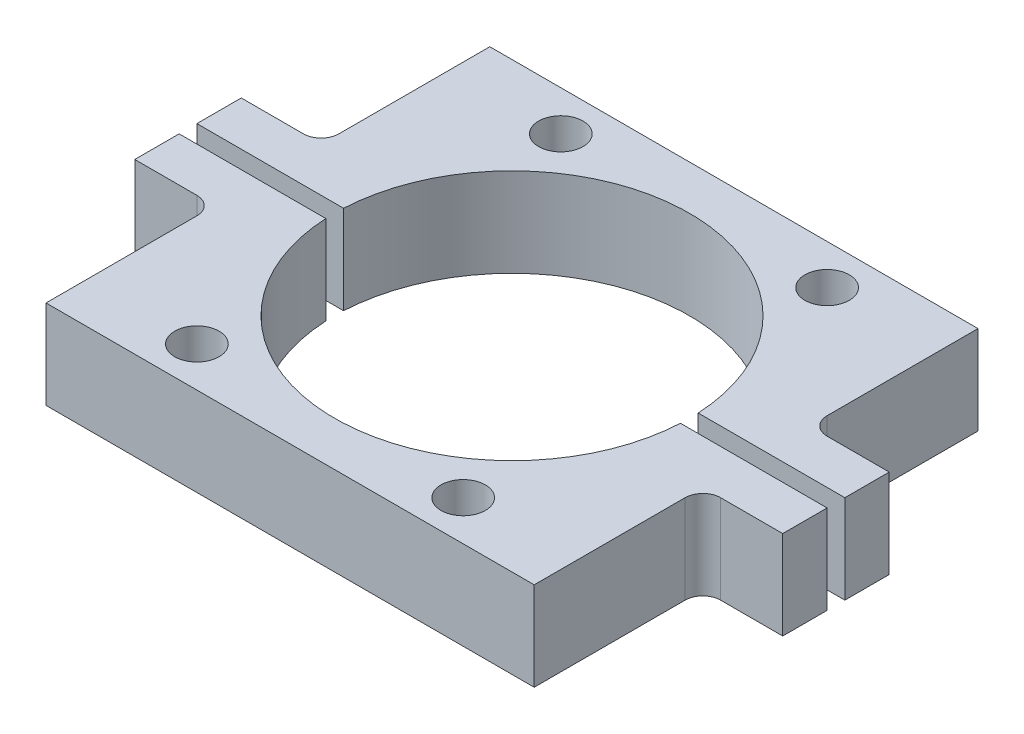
ISO-10303-21;
HEADER;
FILE_DESCRIPTION(('STEP AP214'),'2;1');
FILE_NAME('part.step','',(''),(''),'','','');
FILE_SCHEMA(('AUTOMOTIVE_DESIGN { 1 0 10303 214 1 1 1 1 }'));
ENDSEC;
DATA;
#1=APPLICATION_CONTEXT('core data for automotive mechanical design processes');
#2=APPLICATION_PROTOCOL_DEFINITION('international standard','automotive_design',2000,#1);
#3=PRODUCT_CONTEXT('',#1,'mechanical');
#4=PRODUCT('Part','Part','',(#3));
#5=PRODUCT_RELATED_PRODUCT_CATEGORY('part','',(#4));
#6=PRODUCT_DEFINITION_FORMATION('','',#4);
#7=PRODUCT_DEFINITION_CONTEXT('part definition',#1,'design');
#8=PRODUCT_DEFINITION('design','',#6,#7);
#9=PRODUCT_DEFINITION_SHAPE('','',#8);
#10=(LENGTH_UNIT() NAMED_UNIT(*) SI_UNIT(.MILLI.,.METRE.));
#11=(NAMED_UNIT(*) PLANE_ANGLE_UNIT() SI_UNIT($,.RADIAN.));
#12=(NAMED_UNIT(*) SI_UNIT($,.STERADIAN.) SOLID_ANGLE_UNIT());
#13=UNCERTAINTY_MEASURE_WITH_UNIT(LENGTH_MEASURE(1.E-05),#10,'distance_accuracy_value','');
#14=(GEOMETRIC_REPRESENTATION_CONTEXT(3) GLOBAL_UNCERTAINTY_ASSIGNED_CONTEXT((#13)) GLOBAL_UNIT_ASSIGNED_CONTEXT((#10,
#11,#12)) REPRESENTATION_CONTEXT('',''));
#15=CARTESIAN_POINT('',(0.,0.,0.));
#16=DIRECTION('',(0.,0.,1.));
#17=DIRECTION('',(1.,0.,0.));
#18=AXIS2_PLACEMENT_3D('',#15,#16,#17);
#19=CARTESIAN_POINT('',(0.,20.,0.));
#20=DIRECTION('',(0.,1.,0.));
#21=DIRECTION('',(0.,0.,1.));
#22=AXIS2_PLACEMENT_3D('',#19,#20,#21);
#23=PLANE('',#22);
#24=CARTESIAN_POINT('',(-30.,20.,-41.));
#25=DIRECTION('',(0.,1.,0.));
#26=DIRECTION('',(0.,0.,1.));
#27=AXIS2_PLACEMENT_3D('',#24,#25,#26);
#28=CIRCLE('',#27,5.);
#29=CARTESIAN_POINT('',(-30.,20.,-36.));
#30=VERTEX_POINT('',#29);
#31=EDGE_CURVE('E389',#30,#30,#28,.T.);
#32=ORIENTED_EDGE('',*,*,#31,.F.);
#33=EDGE_LOOP('',(#32));
#34=FACE_BOUND('',#33,.T.);
#35=DIRECTION('',(0.,0.,1.));
#36=VECTOR('',#35,1.);
#37=CARTESIAN_POINT('',(-55.,20.,-12.));
#38=LINE('',#37,#36);
#39=CARTESIAN_POINT('',(-55.,20.,-50.));
#40=VERTEX_POINT('',#39);
#41=CARTESIAN_POINT('',(-55.,20.,-16.));
#42=VERTEX_POINT('',#41);
#43=EDGE_CURVE('E142',#40,#42,#38,.T.);
#44=ORIENTED_EDGE('',*,*,#43,.T.);
#45=CARTESIAN_POINT('',(-59.,20.,-16.));
#46=DIRECTION('',(0.,1.,0.));
#47=DIRECTION('',(0.,0.,1.));
#48=AXIS2_PLACEMENT_3D('',#45,#46,#47);
#49=CIRCLE('',#48,4.);
#50=CARTESIAN_POINT('',(-59.,20.,-12.));
#51=VERTEX_POINT('',#50);
#52=EDGE_CURVE('E138',#42,#51,#49,.F.);
#53=ORIENTED_EDGE('',*,*,#52,.T.);
#54=DIRECTION('',(-1.,0.,0.));
#55=VECTOR('',#54,1.);
#56=CARTESIAN_POINT('',(-55.,20.,-12.));
#57=LINE('',#56,#55);
#58=CARTESIAN_POINT('',(-73.,20.,-12.));
#59=VERTEX_POINT('',#58);
#60=EDGE_CURVE('E130',#51,#59,#57,.T.);
#61=ORIENTED_EDGE('',*,*,#60,.T.);
#62=DIRECTION('',(0.,0.,1.));
#63=VECTOR('',#62,1.);
#64=CARTESIAN_POINT('',(-73.,20.,-12.));
#65=LINE('',#64,#63);
#66=CARTESIAN_POINT('',(-73.,20.,-2.));
#67=VERTEX_POINT('',#66);
#68=EDGE_CURVE('E135',#59,#67,#65,.T.);
#69=ORIENTED_EDGE('',*,*,#68,.T.);
#70=DIRECTION('',(1.,0.,0.));
#71=VECTOR('',#70,1.);
#72=CARTESIAN_POINT('',(-39.9499687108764,20.,-2.));
#73=LINE('',#72,#71);
#74=CARTESIAN_POINT('',(-39.9499687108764,20.,-2.00000000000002));
#75=VERTEX_POINT('',#74);
#76=EDGE_CURVE('E157',#67,#75,#73,.T.);
#77=ORIENTED_EDGE('',*,*,#76,.T.);
#78=CARTESIAN_POINT('',(0.,20.,0.));
#79=DIRECTION('',(0.,-1.,0.));
#80=DIRECTION('',(0.,0.,1.));
#81=AXIS2_PLACEMENT_3D('',#78,#79,#80);
#82=CIRCLE('',#81,40.);
#83=CARTESIAN_POINT('',(39.9499687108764,20.,-2.));
#84=VERTEX_POINT('',#83);
#85=EDGE_CURVE('E159',#75,#84,#82,.T.);
#86=ORIENTED_EDGE('',*,*,#85,.T.);
#87=DIRECTION('',(1.,0.,0.));
#88=VECTOR('',#87,1.);
#89=CARTESIAN_POINT('',(73.,20.,-2.));
#90=LINE('',#89,#88);
#91=CARTESIAN_POINT('',(73.,20.,-2.));
#92=VERTEX_POINT('',#91);
#93=EDGE_CURVE('E164',#84,#92,#90,.T.);
#94=ORIENTED_EDGE('',*,*,#93,.T.);
#95=DIRECTION('',(0.,0.,-1.));
#96=VECTOR('',#95,1.);
#97=CARTESIAN_POINT('',(73.,20.,-12.));
#98=LINE('',#97,#96);
#99=CARTESIAN_POINT('',(73.,20.,-12.));
#100=VERTEX_POINT('',#99);
#101=EDGE_CURVE('E166',#92,#100,#98,.T.);
#102=ORIENTED_EDGE('',*,*,#101,.T.);
#103=DIRECTION('',(-1.,0.,0.));
#104=VECTOR('',#103,1.);
#105=CARTESIAN_POINT('',(73.,20.,-12.));
#106=LINE('',#105,#104);
#107=CARTESIAN_POINT('',(59.,20.,-12.));
#108=VERTEX_POINT('',#107);
#109=EDGE_CURVE('E168',#100,#108,#106,.T.);
#110=ORIENTED_EDGE('',*,*,#109,.T.);
#111=CARTESIAN_POINT('',(59.,20.,-16.));
#112=DIRECTION('',(0.,1.,0.));
#113=DIRECTION('',(0.,0.,1.));
#114=AXIS2_PLACEMENT_3D('',#111,#112,#113);
#115=CIRCLE('',#114,4.);
#116=CARTESIAN_POINT('',(55.,20.,-16.));
#117=VERTEX_POINT('',#116);
#118=EDGE_CURVE('E12',#108,#117,#115,.F.);
#119=ORIENTED_EDGE('',*,*,#118,.T.);
#120=DIRECTION('',(0.,0.,-1.));
#121=VECTOR('',#120,1.);
#122=CARTESIAN_POINT('',(55.,20.,-12.));
#123=LINE('',#122,#121);
#124=CARTESIAN_POINT('',(55.,20.,-50.));
#125=VERTEX_POINT('',#124);
#126=EDGE_CURVE('E170',#117,#125,#123,.T.);
#127=ORIENTED_EDGE('',*,*,#126,.T.);
#128=DIRECTION('',(-1.,0.,0.));
#129=VECTOR('',#128,1.);
#130=CARTESIAN_POINT('',(55.,20.,-50.));
#131=LINE('',#130,#129);
#132=EDGE_CURVE('E172',#125,#40,#131,.T.);
#133=ORIENTED_EDGE('',*,*,#132,.T.);
#134=EDGE_LOOP('',(#44,#53,#61,#69,#77,#86,#94,#102,#110,#119,#127,#133));
#135=FACE_BOUND('',#134,.T.);
#136=CARTESIAN_POINT('',(30.,20.,-41.));
#137=DIRECTION('',(0.,1.,0.));
#138=DIRECTION('',(0.,0.,1.));
#139=AXIS2_PLACEMENT_3D('',#136,#137,#138);
#140=CIRCLE('',#139,5.);
#141=CARTESIAN_POINT('',(30.,20.,-36.));
#142=VERTEX_POINT('',#141);
#143=EDGE_CURVE('E178',#142,#142,#140,.T.);
#144=ORIENTED_EDGE('',*,*,#143,.F.);
#145=EDGE_LOOP('',(#144));
#146=FACE_BOUND('',#145,.T.);
#147=ADVANCED_FACE('F42',(#34,#135,#146),#23,.T.);
#148=CARTESIAN_POINT('',(0.,0.,0.));
#149=DIRECTION('',(0.,1.,0.));
#150=DIRECTION('',(0.,0.,1.));
#151=AXIS2_PLACEMENT_3D('',#148,#149,#150);
#152=PLANE('',#151);
#153=CARTESIAN_POINT('',(-30.,0.,-41.));
#154=DIRECTION('',(0.,1.,0.));
#155=DIRECTION('',(0.,0.,1.));
#156=AXIS2_PLACEMENT_3D('',#153,#154,#155);
#157=CIRCLE('',#156,5.);
#158=CARTESIAN_POINT('',(-30.,0.,-36.));
#159=VERTEX_POINT('',#158);
#160=EDGE_CURVE('E392',#159,#159,#157,.T.);
#161=ORIENTED_EDGE('',*,*,#160,.T.);
#162=EDGE_LOOP('',(#161));
#163=FACE_BOUND('',#162,.T.);
#164=DIRECTION('',(0.,0.,1.));
#165=VECTOR('',#164,1.);
#166=CARTESIAN_POINT('',(-55.,0.,-12.));
#167=LINE('',#166,#165);
#168=CARTESIAN_POINT('',(-55.,0.,-50.));
#169=VERTEX_POINT('',#168);
#170=CARTESIAN_POINT('',(-55.,0.,-16.));
#171=VERTEX_POINT('',#170);
#172=EDGE_CURVE('E175',#169,#171,#167,.T.);
#173=ORIENTED_EDGE('',*,*,#172,.F.);
#174=DIRECTION('',(-1.,0.,0.));
#175=VECTOR('',#174,1.);
#176=CARTESIAN_POINT('',(55.,0.,-50.));
#177=LINE('',#176,#175);
#178=CARTESIAN_POINT('',(55.,0.,-50.));
#179=VERTEX_POINT('',#178);
#180=EDGE_CURVE('E194',#179,#169,#177,.T.);
#181=ORIENTED_EDGE('',*,*,#180,.F.);
#182=DIRECTION('',(0.,0.,-1.));
#183=VECTOR('',#182,1.);
#184=CARTESIAN_POINT('',(55.,0.,-12.));
#185=LINE('',#184,#183);
#186=CARTESIAN_POINT('',(55.,0.,-16.));
#187=VERTEX_POINT('',#186);
#188=EDGE_CURVE('E192',#187,#179,#185,.T.);
#189=ORIENTED_EDGE('',*,*,#188,.F.);
#190=CARTESIAN_POINT('',(59.,0.,-16.));
#191=DIRECTION('',(0.,1.,0.));
#192=DIRECTION('',(0.,0.,1.));
#193=AXIS2_PLACEMENT_3D('',#190,#191,#192);
#194=CIRCLE('',#193,4.);
#195=CARTESIAN_POINT('',(59.,0.,-12.));
#196=VERTEX_POINT('',#195);
#197=EDGE_CURVE('E50',#187,#196,#194,.T.);
#198=ORIENTED_EDGE('',*,*,#197,.T.);
#199=DIRECTION('',(-1.,0.,0.));
#200=VECTOR('',#199,1.);
#201=CARTESIAN_POINT('',(73.,0.,-12.));
#202=LINE('',#201,#200);
#203=CARTESIAN_POINT('',(73.,0.,-12.));
#204=VERTEX_POINT('',#203);
#205=EDGE_CURVE('E190',#204,#196,#202,.T.);
#206=ORIENTED_EDGE('',*,*,#205,.F.);
#207=DIRECTION('',(0.,0.,-1.));
#208=VECTOR('',#207,1.);
#209=CARTESIAN_POINT('',(73.,0.,-12.));
#210=LINE('',#209,#208);
#211=CARTESIAN_POINT('',(73.,0.,-2.));
#212=VERTEX_POINT('',#211);
#213=EDGE_CURVE('E188',#212,#204,#210,.T.);
#214=ORIENTED_EDGE('',*,*,#213,.F.);
#215=DIRECTION('',(1.,0.,0.));
#216=VECTOR('',#215,1.);
#217=CARTESIAN_POINT('',(73.,0.,-2.));
#218=LINE('',#217,#216);
#219=CARTESIAN_POINT('',(39.9499687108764,0.,-2.));
#220=VERTEX_POINT('',#219);
#221=EDGE_CURVE('E186',#220,#212,#218,.T.);
#222=ORIENTED_EDGE('',*,*,#221,.F.);
#223=CARTESIAN_POINT('',(0.,0.,0.));
#224=DIRECTION('',(0.,-1.,0.));
#225=DIRECTION('',(0.,0.,1.));
#226=AXIS2_PLACEMENT_3D('',#223,#224,#225);
#227=CIRCLE('',#226,40.);
#228=CARTESIAN_POINT('',(-39.9499687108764,0.,-2.00000000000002));
#229=VERTEX_POINT('',#228);
#230=EDGE_CURVE('E184',#229,#220,#227,.T.);
#231=ORIENTED_EDGE('',*,*,#230,.F.);
#232=DIRECTION('',(1.,0.,0.));
#233=VECTOR('',#232,1.);
#234=CARTESIAN_POINT('',(-39.9499687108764,0.,-2.));
#235=LINE('',#234,#233);
#236=CARTESIAN_POINT('',(-73.,0.,-2.));
#237=VERTEX_POINT('',#236);
#238=EDGE_CURVE('E182',#237,#229,#235,.T.);
#239=ORIENTED_EDGE('',*,*,#238,.F.);
#240=DIRECTION('',(0.,0.,1.));
#241=VECTOR('',#240,1.);
#242=CARTESIAN_POINT('',(-73.,0.,-12.));
#243=LINE('',#242,#241);
#244=CARTESIAN_POINT('',(-73.,0.,-12.));
#245=VERTEX_POINT('',#244);
#246=EDGE_CURVE('E180',#245,#237,#243,.T.);
#247=ORIENTED_EDGE('',*,*,#246,.F.);
#248=DIRECTION('',(-1.,0.,0.));
#249=VECTOR('',#248,1.);
#250=CARTESIAN_POINT('',(-55.,0.,-12.));
#251=LINE('',#250,#249);
#252=CARTESIAN_POINT('',(-59.,0.,-12.));
#253=VERTEX_POINT('',#252);
#254=EDGE_CURVE('E148',#253,#245,#251,.T.);
#255=ORIENTED_EDGE('',*,*,#254,.F.);
#256=CARTESIAN_POINT('',(-59.,0.,-16.));
#257=DIRECTION('',(0.,1.,0.));
#258=DIRECTION('',(0.,0.,1.));
#259=AXIS2_PLACEMENT_3D('',#256,#257,#258);
#260=CIRCLE('',#259,4.);
#261=EDGE_CURVE('E221',#253,#171,#260,.T.);
#262=ORIENTED_EDGE('',*,*,#261,.T.);
#263=EDGE_LOOP('',(#173,#181,#189,#198,#206,#214,#222,#231,#239,#247,#255,#262));
#264=FACE_BOUND('',#263,.T.);
#265=CARTESIAN_POINT('',(30.,0.,-41.));
#266=DIRECTION('',(0.,1.,0.));
#267=DIRECTION('',(0.,0.,1.));
#268=AXIS2_PLACEMENT_3D('',#265,#266,#267);
#269=CIRCLE('',#268,5.);
#270=CARTESIAN_POINT('',(30.,0.,-36.));
#271=VERTEX_POINT('',#270);
#272=EDGE_CURVE('E394',#271,#271,#269,.T.);
#273=ORIENTED_EDGE('',*,*,#272,.T.);
#274=EDGE_LOOP('',(#273));
#275=FACE_BOUND('',#274,.T.);
#276=ADVANCED_FACE('F224',(#163,#264,#275),#152,.F.);
#277=CARTESIAN_POINT('',(-55.,20.,-12.));
#278=DIRECTION('',(1.,0.,0.));
#279=DIRECTION('',(0.,0.,-1.));
#280=AXIS2_PLACEMENT_3D('',#277,#278,#279);
#281=PLANE('',#280);
#282=ORIENTED_EDGE('',*,*,#172,.T.);
#283=DIRECTION('',(0.,-1.,0.));
#284=VECTOR('',#283,1.);
#285=CARTESIAN_POINT('',(-55.,20.,-16.));
#286=LINE('',#285,#284);
#287=EDGE_CURVE('E215',#171,#42,#286,.F.);
#288=ORIENTED_EDGE('',*,*,#287,.T.);
#289=ORIENTED_EDGE('',*,*,#43,.F.);
#290=DIRECTION('',(0.,-1.,0.));
#291=VECTOR('',#290,1.);
#292=CARTESIAN_POINT('',(-55.,20.,-50.));
#293=LINE('',#292,#291);
#294=EDGE_CURVE('E174',#40,#169,#293,.T.);
#295=ORIENTED_EDGE('',*,*,#294,.T.);
#296=EDGE_LOOP('',(#282,#288,#289,#295));
#297=FACE_BOUND('',#296,.T.);
#298=ADVANCED_FACE('F230',(#297),#281,.F.);
#299=CARTESIAN_POINT('',(-55.,20.,-12.));
#300=DIRECTION('',(0.,0.,1.));
#301=DIRECTION('',(1.,0.,0.));
#302=AXIS2_PLACEMENT_3D('',#299,#300,#301);
#303=PLANE('',#302);
#304=ORIENTED_EDGE('',*,*,#60,.F.);
#305=DIRECTION('',(0.,-1.,0.));
#306=VECTOR('',#305,1.);
#307=CARTESIAN_POINT('',(-59.,0.,-12.));
#308=LINE('',#307,#306);
#309=EDGE_CURVE('E151',#51,#253,#308,.T.);
#310=ORIENTED_EDGE('',*,*,#309,.T.);
#311=ORIENTED_EDGE('',*,*,#254,.T.);
#312=DIRECTION('',(0.,-1.,0.));
#313=VECTOR('',#312,1.);
#314=CARTESIAN_POINT('',(-73.,20.,-12.));
#315=LINE('',#314,#313);
#316=EDGE_CURVE('E145',#59,#245,#315,.T.);
#317=ORIENTED_EDGE('',*,*,#316,.F.);
#318=EDGE_LOOP('',(#304,#310,#311,#317));
#319=FACE_BOUND('',#318,.T.);
#320=ADVANCED_FACE('F146',(#319),#303,.F.);
#321=CARTESIAN_POINT('',(-73.,20.,-12.));
#322=DIRECTION('',(1.,0.,0.));
#323=DIRECTION('',(0.,0.,-1.));
#324=AXIS2_PLACEMENT_3D('',#321,#322,#323);
#325=PLANE('',#324);
#326=ORIENTED_EDGE('',*,*,#246,.T.);
#327=DIRECTION('',(0.,-1.,0.));
#328=VECTOR('',#327,1.);
#329=CARTESIAN_POINT('',(-73.,20.,-2.));
#330=LINE('',#329,#328);
#331=EDGE_CURVE('E152',#67,#237,#330,.T.);
#332=ORIENTED_EDGE('',*,*,#331,.F.);
#333=ORIENTED_EDGE('',*,*,#68,.F.);
#334=ORIENTED_EDGE('',*,*,#316,.T.);
#335=EDGE_LOOP('',(#326,#332,#333,#334));
#336=FACE_BOUND('',#335,.T.);
#337=ADVANCED_FACE('F154',(#336),#325,.F.);
#338=CARTESIAN_POINT('',(-39.9499687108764,20.,-2.));
#339=DIRECTION('',(0.,0.,-1.));
#340=DIRECTION('',(-1.,0.,0.));
#341=AXIS2_PLACEMENT_3D('',#338,#339,#340);
#342=PLANE('',#341);
#343=ORIENTED_EDGE('',*,*,#238,.T.);
#344=DIRECTION('',(0.,-1.,0.));
#345=VECTOR('',#344,1.);
#346=CARTESIAN_POINT('',(-39.9499687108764,20.,-2.00000000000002));
#347=LINE('',#346,#345);
#348=EDGE_CURVE('E210',#75,#229,#347,.T.);
#349=ORIENTED_EDGE('',*,*,#348,.F.);
#350=ORIENTED_EDGE('',*,*,#76,.F.);
#351=ORIENTED_EDGE('',*,*,#331,.T.);
#352=EDGE_LOOP('',(#343,#349,#350,#351));
#353=FACE_BOUND('',#352,.T.);
#354=ADVANCED_FACE('F278',(#353),#342,.F.);
#355=CARTESIAN_POINT('',(0.,20.,0.));
#356=DIRECTION('',(0.,-1.,0.));
#357=DIRECTION('',(0.,0.,-1.));
#358=AXIS2_PLACEMENT_3D('',#355,#356,#357);
#359=CYLINDRICAL_SURFACE('',#358,40.);
#360=ORIENTED_EDGE('',*,*,#230,.T.);
#361=DIRECTION('',(0.,-1.,0.));
#362=VECTOR('',#361,1.);
#363=CARTESIAN_POINT('',(39.9499687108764,20.,-2.));
#364=LINE('',#363,#362);
#365=EDGE_CURVE('E207',#84,#220,#364,.T.);
#366=ORIENTED_EDGE('',*,*,#365,.F.);
#367=ORIENTED_EDGE('',*,*,#85,.F.);
#368=ORIENTED_EDGE('',*,*,#348,.T.);
#369=EDGE_LOOP('',(#360,#366,#367,#368));
#370=FACE_BOUND('',#369,.T.);
#371=ADVANCED_FACE('F274',(#370),#359,.F.);
#372=CARTESIAN_POINT('',(73.,20.,-2.));
#373=DIRECTION('',(0.,0.,-1.));
#374=DIRECTION('',(-1.,0.,0.));
#375=AXIS2_PLACEMENT_3D('',#372,#373,#374);
#376=PLANE('',#375);
#377=ORIENTED_EDGE('',*,*,#221,.T.);
#378=DIRECTION('',(0.,-1.,0.));
#379=VECTOR('',#378,1.);
#380=CARTESIAN_POINT('',(73.,20.,-2.));
#381=LINE('',#380,#379);
#382=EDGE_CURVE('E204',#92,#212,#381,.T.);
#383=ORIENTED_EDGE('',*,*,#382,.F.);
#384=ORIENTED_EDGE('',*,*,#93,.F.);
#385=ORIENTED_EDGE('',*,*,#365,.T.);
#386=EDGE_LOOP('',(#377,#383,#384,#385));
#387=FACE_BOUND('',#386,.T.);
#388=ADVANCED_FACE('F270',(#387),#376,.F.);
#389=CARTESIAN_POINT('',(73.,20.,-12.));
#390=DIRECTION('',(-1.,0.,0.));
#391=DIRECTION('',(0.,0.,1.));
#392=AXIS2_PLACEMENT_3D('',#389,#390,#391);
#393=PLANE('',#392);
#394=ORIENTED_EDGE('',*,*,#213,.T.);
#395=DIRECTION('',(0.,-1.,0.));
#396=VECTOR('',#395,1.);
#397=CARTESIAN_POINT('',(73.,20.,-12.));
#398=LINE('',#397,#396);
#399=EDGE_CURVE('E201',#100,#204,#398,.T.);
#400=ORIENTED_EDGE('',*,*,#399,.F.);
#401=ORIENTED_EDGE('',*,*,#101,.F.);
#402=ORIENTED_EDGE('',*,*,#382,.T.);
#403=EDGE_LOOP('',(#394,#400,#401,#402));
#404=FACE_BOUND('',#403,.T.);
#405=ADVANCED_FACE('F267',(#404),#393,.F.);
#406=CARTESIAN_POINT('',(73.,20.,-12.));
#407=DIRECTION('',(0.,0.,1.));
#408=DIRECTION('',(1.,0.,0.));
#409=AXIS2_PLACEMENT_3D('',#406,#407,#408);
#410=PLANE('',#409);
#411=ORIENTED_EDGE('',*,*,#205,.T.);
#412=DIRECTION('',(0.,-1.,0.));
#413=VECTOR('',#412,1.);
#414=CARTESIAN_POINT('',(59.,20.,-12.));
#415=LINE('',#414,#413);
#416=EDGE_CURVE('E57',#196,#108,#415,.F.);
#417=ORIENTED_EDGE('',*,*,#416,.T.);
#418=ORIENTED_EDGE('',*,*,#109,.F.);
#419=ORIENTED_EDGE('',*,*,#399,.T.);
#420=EDGE_LOOP('',(#411,#417,#418,#419));
#421=FACE_BOUND('',#420,.T.);
#422=ADVANCED_FACE('F263',(#421),#410,.F.);
#423=CARTESIAN_POINT('',(55.,20.,-12.));
#424=DIRECTION('',(-1.,0.,0.));
#425=DIRECTION('',(0.,0.,1.));
#426=AXIS2_PLACEMENT_3D('',#423,#424,#425);
#427=PLANE('',#426);
#428=ORIENTED_EDGE('',*,*,#126,.F.);
#429=DIRECTION('',(0.,-1.,0.));
#430=VECTOR('',#429,1.);
#431=CARTESIAN_POINT('',(55.,0.,-16.));
#432=LINE('',#431,#430);
#433=EDGE_CURVE('E217',#117,#187,#432,.T.);
#434=ORIENTED_EDGE('',*,*,#433,.T.);
#435=ORIENTED_EDGE('',*,*,#188,.T.);
#436=DIRECTION('',(0.,-1.,0.));
#437=VECTOR('',#436,1.);
#438=CARTESIAN_POINT('',(55.,20.,-50.));
#439=LINE('',#438,#437);
#440=EDGE_CURVE('E198',#125,#179,#439,.T.);
#441=ORIENTED_EDGE('',*,*,#440,.F.);
#442=EDGE_LOOP('',(#428,#434,#435,#441));
#443=FACE_BOUND('',#442,.T.);
#444=ADVANCED_FACE('F259',(#443),#427,.F.);
#445=CARTESIAN_POINT('',(55.,20.,-50.));
#446=DIRECTION('',(0.,0.,1.));
#447=DIRECTION('',(1.,0.,0.));
#448=AXIS2_PLACEMENT_3D('',#445,#446,#447);
#449=PLANE('',#448);
#450=ORIENTED_EDGE('',*,*,#180,.T.);
#451=ORIENTED_EDGE('',*,*,#294,.F.);
#452=ORIENTED_EDGE('',*,*,#132,.F.);
#453=ORIENTED_EDGE('',*,*,#440,.T.);
#454=EDGE_LOOP('',(#450,#451,#452,#453));
#455=FACE_BOUND('',#454,.T.);
#456=ADVANCED_FACE('F256',(#455),#449,.F.);
#457=CARTESIAN_POINT('',(-30.,20.,-41.));
#458=DIRECTION('',(0.,-1.,0.));
#459=DIRECTION('',(0.,0.,-1.));
#460=AXIS2_PLACEMENT_3D('',#457,#458,#459);
#461=CYLINDRICAL_SURFACE('',#460,5.);
#462=ORIENTED_EDGE('',*,*,#31,.T.);
#463=EDGE_LOOP('',(#462));
#464=FACE_BOUND('',#463,.T.);
#465=ORIENTED_EDGE('',*,*,#160,.F.);
#466=EDGE_LOOP('',(#465));
#467=FACE_BOUND('',#466,.T.);
#468=ADVANCED_FACE('F241',(#464,#467),#461,.F.);
#469=CARTESIAN_POINT('',(30.,20.,-41.));
#470=DIRECTION('',(0.,-1.,0.));
#471=DIRECTION('',(0.,0.,-1.));
#472=AXIS2_PLACEMENT_3D('',#469,#470,#471);
#473=CYLINDRICAL_SURFACE('',#472,5.);
#474=ORIENTED_EDGE('',*,*,#143,.T.);
#475=EDGE_LOOP('',(#474));
#476=FACE_BOUND('',#475,.T.);
#477=ORIENTED_EDGE('',*,*,#272,.F.);
#478=EDGE_LOOP('',(#477));
#479=FACE_BOUND('',#478,.T.);
#480=ADVANCED_FACE('F235',(#476,#479),#473,.F.);
#481=CARTESIAN_POINT('',(-59.,20.,-16.));
#482=DIRECTION('',(0.,1.,0.));
#483=DIRECTION('',(0.,0.,1.));
#484=AXIS2_PLACEMENT_3D('',#481,#482,#483);
#485=CYLINDRICAL_SURFACE('',#484,4.);
#486=ORIENTED_EDGE('',*,*,#52,.F.);
#487=ORIENTED_EDGE('',*,*,#287,.F.);
#488=ORIENTED_EDGE('',*,*,#261,.F.);
#489=ORIENTED_EDGE('',*,*,#309,.F.);
#490=EDGE_LOOP('',(#486,#487,#488,#489));
#491=FACE_BOUND('',#490,.T.);
#492=ADVANCED_FACE('F233',(#491),#485,.F.);
#493=CARTESIAN_POINT('',(59.,20.,-16.));
#494=DIRECTION('',(0.,1.,0.));
#495=DIRECTION('',(0.,0.,1.));
#496=AXIS2_PLACEMENT_3D('',#493,#494,#495);
#497=CYLINDRICAL_SURFACE('',#496,4.);
#498=ORIENTED_EDGE('',*,*,#118,.F.);
#499=ORIENTED_EDGE('',*,*,#416,.F.);
#500=ORIENTED_EDGE('',*,*,#197,.F.);
#501=ORIENTED_EDGE('',*,*,#433,.F.);
#502=EDGE_LOOP('',(#498,#499,#500,#501));
#503=FACE_BOUND('',#502,.T.);
#504=ADVANCED_FACE('F44',(#503),#497,.F.);
#505=CLOSED_SHELL('',(#147,#276,#298,#320,#337,#354,#371,#388,#405,#422,#444,#456,#468,#480,
#492,#504));
#506=MANIFOLD_SOLID_BREP('B2',#505);
#507=CARTESIAN_POINT('',(0.,20.,0.));
#508=DIRECTION('',(0.,1.,0.));
#509=DIRECTION('',(0.,0.,1.));
#510=AXIS2_PLACEMENT_3D('',#507,#508,#509);
#511=PLANE('',#510);
#512=CARTESIAN_POINT('',(30.,20.,41.));
#513=DIRECTION('',(0.,1.,0.));
#514=DIRECTION('',(0.,0.,1.));
#515=AXIS2_PLACEMENT_3D('',#512,#513,#514);
#516=CIRCLE('',#515,4.99999999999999);
#517=CARTESIAN_POINT('',(30.,20.,46.));
#518=VERTEX_POINT('',#517);
#519=EDGE_CURVE('E761',#518,#518,#516,.T.);
#520=ORIENTED_EDGE('',*,*,#519,.F.);
#521=EDGE_LOOP('',(#520));
#522=FACE_BOUND('',#521,.T.);
#523=DIRECTION('',(1.,0.,0.));
#524=VECTOR('',#523,1.);
#525=CARTESIAN_POINT('',(-55.,20.,12.));
#526=LINE('',#525,#524);
#527=CARTESIAN_POINT('',(-73.,20.,12.));
#528=VERTEX_POINT('',#527);
#529=CARTESIAN_POINT('',(-59.,20.,12.));
#530=VERTEX_POINT('',#529);
#531=EDGE_CURVE('E521',#528,#530,#526,.T.);
#532=ORIENTED_EDGE('',*,*,#531,.T.);
#533=CARTESIAN_POINT('',(-59.,20.,16.));
#534=DIRECTION('',(0.,1.,0.));
#535=DIRECTION('',(0.,0.,1.));
#536=AXIS2_PLACEMENT_3D('',#533,#534,#535);
#537=CIRCLE('',#536,4.);
#538=CARTESIAN_POINT('',(-55.,20.,16.));
#539=VERTEX_POINT('',#538);
#540=EDGE_CURVE('E517',#530,#539,#537,.F.);
#541=ORIENTED_EDGE('',*,*,#540,.T.);
#542=DIRECTION('',(0.,0.,1.));
#543=VECTOR('',#542,1.);
#544=CARTESIAN_POINT('',(-55.,20.,50.));
#545=LINE('',#544,#543);
#546=CARTESIAN_POINT('',(-55.,20.,50.));
#547=VERTEX_POINT('',#546);
#548=EDGE_CURVE('E509',#539,#547,#545,.T.);
#549=ORIENTED_EDGE('',*,*,#548,.T.);
#550=DIRECTION('',(1.,0.,0.));
#551=VECTOR('',#550,1.);
#552=CARTESIAN_POINT('',(55.,20.,50.));
#553=LINE('',#552,#551);
#554=CARTESIAN_POINT('',(55.,20.,50.));
#555=VERTEX_POINT('',#554);
#556=EDGE_CURVE('E514',#547,#555,#553,.T.);
#557=ORIENTED_EDGE('',*,*,#556,.T.);
#558=DIRECTION('',(0.,0.,-1.));
#559=VECTOR('',#558,1.);
#560=CARTESIAN_POINT('',(55.,20.,50.));
#561=LINE('',#560,#559);
#562=CARTESIAN_POINT('',(55.,20.,16.));
#563=VERTEX_POINT('',#562);
#564=EDGE_CURVE('E535',#555,#563,#561,.T.);
#565=ORIENTED_EDGE('',*,*,#564,.T.);
#566=CARTESIAN_POINT('',(59.,20.,16.));
#567=DIRECTION('',(0.,1.,0.));
#568=DIRECTION('',(0.,0.,1.));
#569=AXIS2_PLACEMENT_3D('',#566,#567,#568);
#570=CIRCLE('',#569,4.);
#571=CARTESIAN_POINT('',(59.,20.,12.));
#572=VERTEX_POINT('',#571);
#573=EDGE_CURVE('E40',#563,#572,#570,.F.);
#574=ORIENTED_EDGE('',*,*,#573,.T.);
#575=DIRECTION('',(1.,0.,0.));
#576=VECTOR('',#575,1.);
#577=CARTESIAN_POINT('',(73.,20.,12.));
#578=LINE('',#577,#576);
#579=CARTESIAN_POINT('',(73.,20.,12.));
#580=VERTEX_POINT('',#579);
#581=EDGE_CURVE('E537',#572,#580,#578,.T.);
#582=ORIENTED_EDGE('',*,*,#581,.T.);
#583=DIRECTION('',(0.,0.,-1.));
#584=VECTOR('',#583,1.);
#585=CARTESIAN_POINT('',(73.,20.,2.));
#586=LINE('',#585,#584);
#587=CARTESIAN_POINT('',(73.,20.,2.));
#588=VERTEX_POINT('',#587);
#589=EDGE_CURVE('E542',#580,#588,#586,.T.);
#590=ORIENTED_EDGE('',*,*,#589,.T.);
#591=DIRECTION('',(-1.,0.,0.));
#592=VECTOR('',#591,1.);
#593=CARTESIAN_POINT('',(73.,20.,2.));
#594=LINE('',#593,#592);
#595=CARTESIAN_POINT('',(39.9499687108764,20.,2.));
#596=VERTEX_POINT('',#595);
#597=EDGE_CURVE('E544',#588,#596,#594,.T.);
#598=ORIENTED_EDGE('',*,*,#597,.T.);
#599=CARTESIAN_POINT('',(0.,20.,0.));
#600=DIRECTION('',(0.,-1.,0.));
#601=DIRECTION('',(0.,0.,1.));
#602=AXIS2_PLACEMENT_3D('',#599,#600,#601);
#603=CIRCLE('',#602,40.);
#604=CARTESIAN_POINT('',(-39.9499687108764,20.,1.99999999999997));
#605=VERTEX_POINT('',#604);
#606=EDGE_CURVE('E546',#596,#605,#603,.T.);
#607=ORIENTED_EDGE('',*,*,#606,.T.);
#608=DIRECTION('',(-1.,0.,0.));
#609=VECTOR('',#608,1.);
#610=CARTESIAN_POINT('',(-39.9499687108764,20.,2.));
#611=LINE('',#610,#609);
#612=CARTESIAN_POINT('',(-73.,20.,2.));
#613=VERTEX_POINT('',#612);
#614=EDGE_CURVE('E548',#605,#613,#611,.T.);
#615=ORIENTED_EDGE('',*,*,#614,.T.);
#616=DIRECTION('',(0.,0.,1.));
#617=VECTOR('',#616,1.);
#618=CARTESIAN_POINT('',(-73.,20.,2.));
#619=LINE('',#618,#617);
#620=EDGE_CURVE('E550',#613,#528,#619,.T.);
#621=ORIENTED_EDGE('',*,*,#620,.T.);
#622=EDGE_LOOP('',(#532,#541,#549,#557,#565,#574,#582,#590,#598,#607,#615,#621));
#623=FACE_BOUND('',#622,.T.);
#624=CARTESIAN_POINT('',(-30.,20.,41.));
#625=DIRECTION('',(0.,1.,0.));
#626=DIRECTION('',(0.,0.,1.));
#627=AXIS2_PLACEMENT_3D('',#624,#625,#626);
#628=CIRCLE('',#627,5.);
#629=CARTESIAN_POINT('',(-30.,20.,46.));
#630=VERTEX_POINT('',#629);
#631=EDGE_CURVE('E556',#630,#630,#628,.T.);
#632=ORIENTED_EDGE('',*,*,#631,.F.);
#633=EDGE_LOOP('',(#632));
#634=FACE_BOUND('',#633,.T.);
#635=ADVANCED_FACE('F421',(#522,#623,#634),#511,.T.);
#636=CARTESIAN_POINT('',(0.,0.,0.));
#637=DIRECTION('',(0.,1.,0.));
#638=DIRECTION('',(0.,0.,1.));
#639=AXIS2_PLACEMENT_3D('',#636,#637,#638);
#640=PLANE('',#639);
#641=CARTESIAN_POINT('',(30.,0.,41.));
#642=DIRECTION('',(0.,1.,0.));
#643=DIRECTION('',(0.,0.,1.));
#644=AXIS2_PLACEMENT_3D('',#641,#642,#643);
#645=CIRCLE('',#644,4.99999999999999);
#646=CARTESIAN_POINT('',(30.,0.,46.));
#647=VERTEX_POINT('',#646);
#648=EDGE_CURVE('E764',#647,#647,#645,.T.);
#649=ORIENTED_EDGE('',*,*,#648,.T.);
#650=EDGE_LOOP('',(#649));
#651=FACE_BOUND('',#650,.T.);
#652=DIRECTION('',(1.,0.,0.));
#653=VECTOR('',#652,1.);
#654=CARTESIAN_POINT('',(-55.,0.,12.));
#655=LINE('',#654,#653);
#656=CARTESIAN_POINT('',(-73.,0.,12.));
#657=VERTEX_POINT('',#656);
#658=CARTESIAN_POINT('',(-59.,0.,12.));
#659=VERTEX_POINT('',#658);
#660=EDGE_CURVE('E553',#657,#659,#655,.T.);
#661=ORIENTED_EDGE('',*,*,#660,.F.);
#662=DIRECTION('',(0.,0.,1.));
#663=VECTOR('',#662,1.);
#664=CARTESIAN_POINT('',(-73.,0.,2.));
#665=LINE('',#664,#663);
#666=CARTESIAN_POINT('',(-73.,0.,2.));
#667=VERTEX_POINT('',#666);
#668=EDGE_CURVE('E572',#667,#657,#665,.T.);
#669=ORIENTED_EDGE('',*,*,#668,.F.);
#670=DIRECTION('',(-1.,0.,0.));
#671=VECTOR('',#670,1.);
#672=CARTESIAN_POINT('',(-39.9499687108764,0.,2.));
#673=LINE('',#672,#671);
#674=CARTESIAN_POINT('',(-39.9499687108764,0.,1.99999999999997));
#675=VERTEX_POINT('',#674);
#676=EDGE_CURVE('E570',#675,#667,#673,.T.);
#677=ORIENTED_EDGE('',*,*,#676,.F.);
#678=CARTESIAN_POINT('',(0.,0.,0.));
#679=DIRECTION('',(0.,-1.,0.));
#680=DIRECTION('',(0.,0.,1.));
#681=AXIS2_PLACEMENT_3D('',#678,#679,#680);
#682=CIRCLE('',#681,40.);
#683=CARTESIAN_POINT('',(39.9499687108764,0.,2.));
#684=VERTEX_POINT('',#683);
#685=EDGE_CURVE('E568',#684,#675,#682,.T.);
#686=ORIENTED_EDGE('',*,*,#685,.F.);
#687=DIRECTION('',(-1.,0.,0.));
#688=VECTOR('',#687,1.);
#689=CARTESIAN_POINT('',(73.,0.,2.));
#690=LINE('',#689,#688);
#691=CARTESIAN_POINT('',(73.,0.,2.));
#692=VERTEX_POINT('',#691);
#693=EDGE_CURVE('E566',#692,#684,#690,.T.);
#694=ORIENTED_EDGE('',*,*,#693,.F.);
#695=DIRECTION('',(0.,0.,-1.));
#696=VECTOR('',#695,1.);
#697=CARTESIAN_POINT('',(73.,0.,2.));
#698=LINE('',#697,#696);
#699=CARTESIAN_POINT('',(73.,0.,12.));
#700=VERTEX_POINT('',#699);
#701=EDGE_CURVE('E564',#700,#692,#698,.T.);
#702=ORIENTED_EDGE('',*,*,#701,.F.);
#703=DIRECTION('',(1.,0.,0.));
#704=VECTOR('',#703,1.);
#705=CARTESIAN_POINT('',(73.,0.,12.));
#706=LINE('',#705,#704);
#707=CARTESIAN_POINT('',(59.,0.,12.));
#708=VERTEX_POINT('',#707);
#709=EDGE_CURVE('E562',#708,#700,#706,.T.);
#710=ORIENTED_EDGE('',*,*,#709,.F.);
#711=CARTESIAN_POINT('',(59.,0.,16.));
#712=DIRECTION('',(0.,1.,0.));
#713=DIRECTION('',(0.,0.,1.));
#714=AXIS2_PLACEMENT_3D('',#711,#712,#713);
#715=CIRCLE('',#714,4.);
#716=CARTESIAN_POINT('',(55.,0.,16.));
#717=VERTEX_POINT('',#716);
#718=EDGE_CURVE('E429',#708,#717,#715,.T.);
#719=ORIENTED_EDGE('',*,*,#718,.T.);
#720=DIRECTION('',(0.,0.,-1.));
#721=VECTOR('',#720,1.);
#722=CARTESIAN_POINT('',(55.,0.,50.));
#723=LINE('',#722,#721);
#724=CARTESIAN_POINT('',(55.,0.,50.));
#725=VERTEX_POINT('',#724);
#726=EDGE_CURVE('E560',#725,#717,#723,.T.);
#727=ORIENTED_EDGE('',*,*,#726,.F.);
#728=DIRECTION('',(1.,0.,0.));
#729=VECTOR('',#728,1.);
#730=CARTESIAN_POINT('',(55.,0.,50.));
#731=LINE('',#730,#729);
#732=CARTESIAN_POINT('',(-55.,0.,50.));
#733=VERTEX_POINT('',#732);
#734=EDGE_CURVE('E558',#733,#725,#731,.T.);
#735=ORIENTED_EDGE('',*,*,#734,.F.);
#736=DIRECTION('',(0.,0.,1.));
#737=VECTOR('',#736,1.);
#738=CARTESIAN_POINT('',(-55.,0.,50.));
#739=LINE('',#738,#737);
#740=CARTESIAN_POINT('',(-55.,0.,16.));
#741=VERTEX_POINT('',#740);
#742=EDGE_CURVE('E527',#741,#733,#739,.T.);
#743=ORIENTED_EDGE('',*,*,#742,.F.);
#744=CARTESIAN_POINT('',(-59.,0.,16.));
#745=DIRECTION('',(0.,1.,0.));
#746=DIRECTION('',(0.,0.,1.));
#747=AXIS2_PLACEMENT_3D('',#744,#745,#746);
#748=CIRCLE('',#747,4.);
#749=EDGE_CURVE('E599',#741,#659,#748,.T.);
#750=ORIENTED_EDGE('',*,*,#749,.T.);
#751=EDGE_LOOP('',(#661,#669,#677,#686,#694,#702,#710,#719,#727,#735,#743,#750));
#752=FACE_BOUND('',#751,.T.);
#753=CARTESIAN_POINT('',(-30.,0.,41.));
#754=DIRECTION('',(0.,1.,0.));
#755=DIRECTION('',(0.,0.,1.));
#756=AXIS2_PLACEMENT_3D('',#753,#754,#755);
#757=CIRCLE('',#756,5.);
#758=CARTESIAN_POINT('',(-30.,0.,46.));
#759=VERTEX_POINT('',#758);
#760=EDGE_CURVE('E766',#759,#759,#757,.T.);
#761=ORIENTED_EDGE('',*,*,#760,.T.);
#762=EDGE_LOOP('',(#761));
#763=FACE_BOUND('',#762,.T.);
#764=ADVANCED_FACE('F602',(#651,#752,#763),#640,.F.);
#765=CARTESIAN_POINT('',(-55.,20.,12.));
#766=DIRECTION('',(0.,0.,-1.));
#767=DIRECTION('',(-1.,0.,0.));
#768=AXIS2_PLACEMENT_3D('',#765,#766,#767);
#769=PLANE('',#768);
#770=ORIENTED_EDGE('',*,*,#660,.T.);
#771=DIRECTION('',(0.,-1.,0.));
#772=VECTOR('',#771,1.);
#773=CARTESIAN_POINT('',(-59.,20.,12.));
#774=LINE('',#773,#772);
#775=EDGE_CURVE('E593',#659,#530,#774,.F.);
#776=ORIENTED_EDGE('',*,*,#775,.T.);
#777=ORIENTED_EDGE('',*,*,#531,.F.);
#778=DIRECTION('',(0.,-1.,0.));
#779=VECTOR('',#778,1.);
#780=CARTESIAN_POINT('',(-73.,20.,12.));
#781=LINE('',#780,#779);
#782=EDGE_CURVE('E552',#528,#657,#781,.T.);
#783=ORIENTED_EDGE('',*,*,#782,.T.);
#784=EDGE_LOOP('',(#770,#776,#777,#783));
#785=FACE_BOUND('',#784,.T.);
#786=ADVANCED_FACE('F608',(#785),#769,.F.);
#787=CARTESIAN_POINT('',(-55.,20.,50.));
#788=DIRECTION('',(1.,0.,0.));
#789=DIRECTION('',(0.,0.,-1.));
#790=AXIS2_PLACEMENT_3D('',#787,#788,#789);
#791=PLANE('',#790);
#792=ORIENTED_EDGE('',*,*,#548,.F.);
#793=DIRECTION('',(0.,-1.,0.));
#794=VECTOR('',#793,1.);
#795=CARTESIAN_POINT('',(-55.,0.,16.));
#796=LINE('',#795,#794);
#797=EDGE_CURVE('E530',#539,#741,#796,.T.);
#798=ORIENTED_EDGE('',*,*,#797,.T.);
#799=ORIENTED_EDGE('',*,*,#742,.T.);
#800=DIRECTION('',(0.,-1.,0.));
#801=VECTOR('',#800,1.);
#802=CARTESIAN_POINT('',(-55.,20.,50.));
#803=LINE('',#802,#801);
#804=EDGE_CURVE('E524',#547,#733,#803,.T.);
#805=ORIENTED_EDGE('',*,*,#804,.F.);
#806=EDGE_LOOP('',(#792,#798,#799,#805));
#807=FACE_BOUND('',#806,.T.);
#808=ADVANCED_FACE('F525',(#807),#791,.F.);
#809=CARTESIAN_POINT('',(55.,20.,50.));
#810=DIRECTION('',(0.,0.,-1.));
#811=DIRECTION('',(-1.,0.,0.));
#812=AXIS2_PLACEMENT_3D('',#809,#810,#811);
#813=PLANE('',#812);
#814=ORIENTED_EDGE('',*,*,#734,.T.);
#815=DIRECTION('',(0.,-1.,0.));
#816=VECTOR('',#815,1.);
#817=CARTESIAN_POINT('',(55.,20.,50.));
#818=LINE('',#817,#816);
#819=EDGE_CURVE('E531',#555,#725,#818,.T.);
#820=ORIENTED_EDGE('',*,*,#819,.F.);
#821=ORIENTED_EDGE('',*,*,#556,.F.);
#822=ORIENTED_EDGE('',*,*,#804,.T.);
#823=EDGE_LOOP('',(#814,#820,#821,#822));
#824=FACE_BOUND('',#823,.T.);
#825=ADVANCED_FACE('F533',(#824),#813,.F.);
#826=CARTESIAN_POINT('',(55.,20.,50.));
#827=DIRECTION('',(-1.,0.,0.));
#828=DIRECTION('',(0.,0.,1.));
#829=AXIS2_PLACEMENT_3D('',#826,#827,#828);
#830=PLANE('',#829);
#831=ORIENTED_EDGE('',*,*,#726,.T.);
#832=DIRECTION('',(0.,-1.,0.));
#833=VECTOR('',#832,1.);
#834=CARTESIAN_POINT('',(55.,20.,16.));
#835=LINE('',#834,#833);
#836=EDGE_CURVE('E436',#717,#563,#835,.F.);
#837=ORIENTED_EDGE('',*,*,#836,.T.);
#838=ORIENTED_EDGE('',*,*,#564,.F.);
#839=ORIENTED_EDGE('',*,*,#819,.T.);
#840=EDGE_LOOP('',(#831,#837,#838,#839));
#841=FACE_BOUND('',#840,.T.);
#842=ADVANCED_FACE('F657',(#841),#830,.F.);
#843=CARTESIAN_POINT('',(73.,20.,12.));
#844=DIRECTION('',(0.,0.,-1.));
#845=DIRECTION('',(-1.,0.,0.));
#846=AXIS2_PLACEMENT_3D('',#843,#844,#845);
#847=PLANE('',#846);
#848=ORIENTED_EDGE('',*,*,#581,.F.);
#849=DIRECTION('',(0.,-1.,0.));
#850=VECTOR('',#849,1.);
#851=CARTESIAN_POINT('',(59.,0.,12.));
#852=LINE('',#851,#850);
#853=EDGE_CURVE('E595',#572,#708,#852,.T.);
#854=ORIENTED_EDGE('',*,*,#853,.T.);
#855=ORIENTED_EDGE('',*,*,#709,.T.);
#856=DIRECTION('',(0.,-1.,0.));
#857=VECTOR('',#856,1.);
#858=CARTESIAN_POINT('',(73.,20.,12.));
#859=LINE('',#858,#857);
#860=EDGE_CURVE('E588',#580,#700,#859,.T.);
#861=ORIENTED_EDGE('',*,*,#860,.F.);
#862=EDGE_LOOP('',(#848,#854,#855,#861));
#863=FACE_BOUND('',#862,.T.);
#864=ADVANCED_FACE('F653',(#863),#847,.F.);
#865=CARTESIAN_POINT('',(73.,20.,2.));
#866=DIRECTION('',(-1.,0.,0.));
#867=DIRECTION('',(0.,0.,1.));
#868=AXIS2_PLACEMENT_3D('',#865,#866,#867);
#869=PLANE('',#868);
#870=ORIENTED_EDGE('',*,*,#701,.T.);
#871=DIRECTION('',(0.,-1.,0.));
#872=VECTOR('',#871,1.);
#873=CARTESIAN_POINT('',(73.,20.,2.));
#874=LINE('',#873,#872);
#875=EDGE_CURVE('E585',#588,#692,#874,.T.);
#876=ORIENTED_EDGE('',*,*,#875,.F.);
#877=ORIENTED_EDGE('',*,*,#589,.F.);
#878=ORIENTED_EDGE('',*,*,#860,.T.);
#879=EDGE_LOOP('',(#870,#876,#877,#878));
#880=FACE_BOUND('',#879,.T.);
#881=ADVANCED_FACE('F649',(#880),#869,.F.);
#882=CARTESIAN_POINT('',(73.,20.,2.));
#883=DIRECTION('',(0.,0.,1.));
#884=DIRECTION('',(1.,0.,0.));
#885=AXIS2_PLACEMENT_3D('',#882,#883,#884);
#886=PLANE('',#885);
#887=ORIENTED_EDGE('',*,*,#693,.T.);
#888=DIRECTION('',(0.,-1.,0.));
#889=VECTOR('',#888,1.);
#890=CARTESIAN_POINT('',(39.9499687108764,20.,2.));
#891=LINE('',#890,#889);
#892=EDGE_CURVE('E582',#596,#684,#891,.T.);
#893=ORIENTED_EDGE('',*,*,#892,.F.);
#894=ORIENTED_EDGE('',*,*,#597,.F.);
#895=ORIENTED_EDGE('',*,*,#875,.T.);
#896=EDGE_LOOP('',(#887,#893,#894,#895));
#897=FACE_BOUND('',#896,.T.);
#898=ADVANCED_FACE('F645',(#897),#886,.F.);
#899=CARTESIAN_POINT('',(0.,20.,0.));
#900=DIRECTION('',(0.,-1.,0.));
#901=DIRECTION('',(0.,0.,-1.));
#902=AXIS2_PLACEMENT_3D('',#899,#900,#901);
#903=CYLINDRICAL_SURFACE('',#902,40.);
#904=ORIENTED_EDGE('',*,*,#685,.T.);
#905=DIRECTION('',(0.,-1.,0.));
#906=VECTOR('',#905,1.);
#907=CARTESIAN_POINT('',(-39.9499687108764,20.,1.99999999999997));
#908=LINE('',#907,#906);
#909=EDGE_CURVE('E579',#605,#675,#908,.T.);
#910=ORIENTED_EDGE('',*,*,#909,.F.);
#911=ORIENTED_EDGE('',*,*,#606,.F.);
#912=ORIENTED_EDGE('',*,*,#892,.T.);
#913=EDGE_LOOP('',(#904,#910,#911,#912));
#914=FACE_BOUND('',#913,.T.);
#915=ADVANCED_FACE('F641',(#914),#903,.F.);
#916=CARTESIAN_POINT('',(-39.9499687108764,20.,2.));
#917=DIRECTION('',(0.,0.,1.));
#918=DIRECTION('',(1.,0.,0.));
#919=AXIS2_PLACEMENT_3D('',#916,#917,#918);
#920=PLANE('',#919);
#921=ORIENTED_EDGE('',*,*,#676,.T.);
#922=DIRECTION('',(0.,-1.,0.));
#923=VECTOR('',#922,1.);
#924=CARTESIAN_POINT('',(-73.,20.,2.));
#925=LINE('',#924,#923);
#926=EDGE_CURVE('E576',#613,#667,#925,.T.);
#927=ORIENTED_EDGE('',*,*,#926,.F.);
#928=ORIENTED_EDGE('',*,*,#614,.F.);
#929=ORIENTED_EDGE('',*,*,#909,.T.);
#930=EDGE_LOOP('',(#921,#927,#928,#929));
#931=FACE_BOUND('',#930,.T.);
#932=ADVANCED_FACE('F637',(#931),#920,.F.);
#933=CARTESIAN_POINT('',(-73.,20.,2.));
#934=DIRECTION('',(1.,0.,0.));
#935=DIRECTION('',(0.,0.,-1.));
#936=AXIS2_PLACEMENT_3D('',#933,#934,#935);
#937=PLANE('',#936);
#938=ORIENTED_EDGE('',*,*,#668,.T.);
#939=ORIENTED_EDGE('',*,*,#782,.F.);
#940=ORIENTED_EDGE('',*,*,#620,.F.);
#941=ORIENTED_EDGE('',*,*,#926,.T.);
#942=EDGE_LOOP('',(#938,#939,#940,#941));
#943=FACE_BOUND('',#942,.T.);
#944=ADVANCED_FACE('F634',(#943),#937,.F.);
#945=CARTESIAN_POINT('',(30.,20.,41.));
#946=DIRECTION('',(0.,-1.,0.));
#947=DIRECTION('',(0.,0.,-1.));
#948=AXIS2_PLACEMENT_3D('',#945,#946,#947);
#949=CYLINDRICAL_SURFACE('',#948,4.99999999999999);
#950=ORIENTED_EDGE('',*,*,#519,.T.);
#951=EDGE_LOOP('',(#950));
#952=FACE_BOUND('',#951,.T.);
#953=ORIENTED_EDGE('',*,*,#648,.F.);
#954=EDGE_LOOP('',(#953));
#955=FACE_BOUND('',#954,.T.);
#956=ADVANCED_FACE('F619',(#952,#955),#949,.F.);
#957=CARTESIAN_POINT('',(-30.,20.,41.));
#958=DIRECTION('',(0.,-1.,0.));
#959=DIRECTION('',(0.,0.,-1.));
#960=AXIS2_PLACEMENT_3D('',#957,#958,#959);
#961=CYLINDRICAL_SURFACE('',#960,5.);
#962=ORIENTED_EDGE('',*,*,#631,.T.);
#963=EDGE_LOOP('',(#962));
#964=FACE_BOUND('',#963,.T.);
#965=ORIENTED_EDGE('',*,*,#760,.F.);
#966=EDGE_LOOP('',(#965));
#967=FACE_BOUND('',#966,.T.);
#968=ADVANCED_FACE('F613',(#964,#967),#961,.F.);
#969=CARTESIAN_POINT('',(-59.,20.,16.));
#970=DIRECTION('',(0.,1.,0.));
#971=DIRECTION('',(0.,0.,1.));
#972=AXIS2_PLACEMENT_3D('',#969,#970,#971);
#973=CYLINDRICAL_SURFACE('',#972,4.);
#974=ORIENTED_EDGE('',*,*,#540,.F.);
#975=ORIENTED_EDGE('',*,*,#775,.F.);
#976=ORIENTED_EDGE('',*,*,#749,.F.);
#977=ORIENTED_EDGE('',*,*,#797,.F.);
#978=EDGE_LOOP('',(#974,#975,#976,#977));
#979=FACE_BOUND('',#978,.T.);
#980=ADVANCED_FACE('F611',(#979),#973,.F.);
#981=CARTESIAN_POINT('',(59.,20.,16.));
#982=DIRECTION('',(0.,1.,0.));
#983=DIRECTION('',(0.,0.,1.));
#984=AXIS2_PLACEMENT_3D('',#981,#982,#983);
#985=CYLINDRICAL_SURFACE('',#984,4.);
#986=ORIENTED_EDGE('',*,*,#573,.F.);
#987=ORIENTED_EDGE('',*,*,#836,.F.);
#988=ORIENTED_EDGE('',*,*,#718,.F.);
#989=ORIENTED_EDGE('',*,*,#853,.F.);
#990=EDGE_LOOP('',(#986,#987,#988,#989));
#991=FACE_BOUND('',#990,.T.);
#992=ADVANCED_FACE('F423',(#991),#985,.F.);
#993=CLOSED_SHELL('',(#635,#764,#786,#808,#825,#842,#864,#881,#898,#915,#932,#944,#956,#968,
#980,#992));
#994=MANIFOLD_SOLID_BREP('B6',#993);
#995=ADVANCED_BREP_SHAPE_REPRESENTATION('',(#18,#506,#994),#14);
#996=SHAPE_DEFINITION_REPRESENTATION(#9,#995);
ENDSEC;
END-ISO-10303-21;
